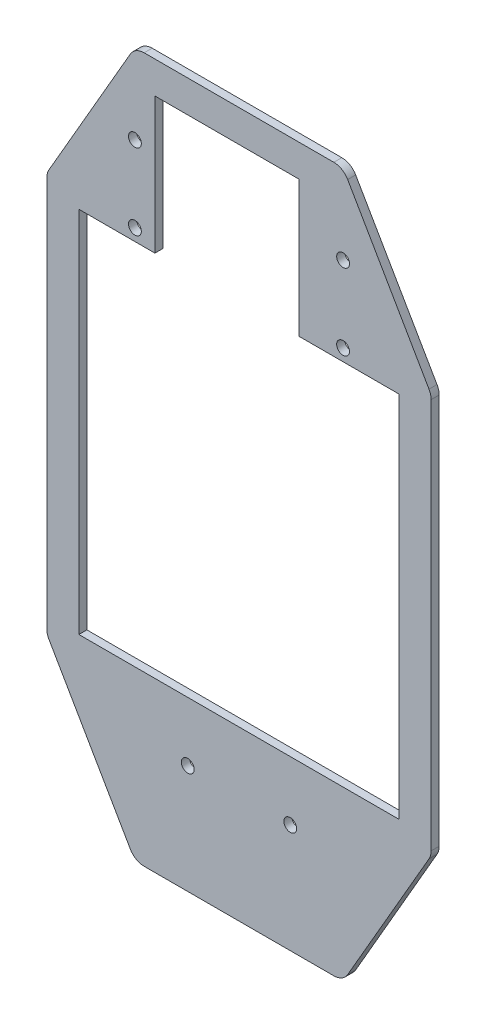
ISO-10303-21;
HEADER;
FILE_DESCRIPTION(('STEP AP214'),'2;1');
FILE_NAME('part.step','',(''),(''),'','','');
FILE_SCHEMA(('AUTOMOTIVE_DESIGN { 1 0 10303 214 1 1 1 1 }'));
ENDSEC;
DATA;
#1=APPLICATION_CONTEXT('core data for automotive mechanical design processes');
#2=APPLICATION_PROTOCOL_DEFINITION('international standard','automotive_design',2000,#1);
#3=PRODUCT_CONTEXT('',#1,'mechanical');
#4=PRODUCT('Part','Part','',(#3));
#5=PRODUCT_RELATED_PRODUCT_CATEGORY('part','',(#4));
#6=PRODUCT_DEFINITION_FORMATION('','',#4);
#7=PRODUCT_DEFINITION_CONTEXT('part definition',#1,'design');
#8=PRODUCT_DEFINITION('design','',#6,#7);
#9=PRODUCT_DEFINITION_SHAPE('','',#8);
#10=(LENGTH_UNIT() NAMED_UNIT(*) SI_UNIT(.MILLI.,.METRE.));
#11=(NAMED_UNIT(*) PLANE_ANGLE_UNIT() SI_UNIT($,.RADIAN.));
#12=(NAMED_UNIT(*) SI_UNIT($,.STERADIAN.) SOLID_ANGLE_UNIT());
#13=UNCERTAINTY_MEASURE_WITH_UNIT(LENGTH_MEASURE(1.E-05),#10,'distance_accuracy_value','');
#14=(GEOMETRIC_REPRESENTATION_CONTEXT(3) GLOBAL_UNCERTAINTY_ASSIGNED_CONTEXT((#13)) GLOBAL_UNIT_ASSIGNED_CONTEXT((#10,
#11,#12)) REPRESENTATION_CONTEXT('',''));
#15=CARTESIAN_POINT('',(0.,0.,0.));
#16=DIRECTION('',(0.,0.,1.));
#17=DIRECTION('',(1.,0.,0.));
#18=AXIS2_PLACEMENT_3D('',#15,#16,#17);
#19=CARTESIAN_POINT('',(0.,0.,4.));
#20=DIRECTION('',(0.,0.,1.));
#21=DIRECTION('',(1.,0.,0.));
#22=AXIS2_PLACEMENT_3D('',#19,#20,#21);
#23=PLANE('',#22);
#24=CARTESIAN_POINT('',(-32.,-152.,4.));
#25=DIRECTION('',(0.,0.,1.));
#26=DIRECTION('',(1.,0.,0.));
#27=AXIS2_PLACEMENT_3D('',#24,#25,#26);
#28=CIRCLE('',#27,4.00000000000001);
#29=CARTESIAN_POINT('',(-28.,-152.,4.));
#30=VERTEX_POINT('',#29);
#31=EDGE_CURVE('E856',#30,#30,#28,.F.);
#32=ORIENTED_EDGE('',*,*,#31,.F.);
#33=EDGE_LOOP('',(#32));
#34=FACE_BOUND('',#33,.T.);
#35=CARTESIAN_POINT('',(-65.,170.,4.));
#36=DIRECTION('',(0.,0.,1.));
#37=DIRECTION('',(1.,0.,0.));
#38=AXIS2_PLACEMENT_3D('',#35,#36,#37);
#39=CIRCLE('',#38,4.00000000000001);
#40=CARTESIAN_POINT('',(-61.,170.,4.));
#41=VERTEX_POINT('',#40);
#42=EDGE_CURVE('E861',#41,#41,#39,.F.);
#43=ORIENTED_EDGE('',*,*,#42,.F.);
#44=EDGE_LOOP('',(#43));
#45=FACE_BOUND('',#44,.T.);
#46=CARTESIAN_POINT('',(-65.,122.5,4.));
#47=DIRECTION('',(0.,0.,1.));
#48=DIRECTION('',(1.,0.,0.));
#49=AXIS2_PLACEMENT_3D('',#46,#47,#48);
#50=CIRCLE('',#49,4.00000000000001);
#51=CARTESIAN_POINT('',(-61.,122.5,4.));
#52=VERTEX_POINT('',#51);
#53=EDGE_CURVE('E864',#52,#52,#50,.F.);
#54=ORIENTED_EDGE('',*,*,#53,.F.);
#55=EDGE_LOOP('',(#54));
#56=FACE_BOUND('',#55,.T.);
#57=CARTESIAN_POINT('',(32.,-152.,4.));
#58=DIRECTION('',(0.,0.,1.));
#59=DIRECTION('',(1.,0.,0.));
#60=AXIS2_PLACEMENT_3D('',#57,#58,#59);
#61=CIRCLE('',#60,4.00000000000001);
#62=CARTESIAN_POINT('',(36.,-152.,4.));
#63=VERTEX_POINT('',#62);
#64=EDGE_CURVE('E809',#63,#63,#61,.T.);
#65=ORIENTED_EDGE('',*,*,#64,.T.);
#66=EDGE_LOOP('',(#65));
#67=FACE_BOUND('',#66,.T.);
#68=CARTESIAN_POINT('',(65.,170.,4.));
#69=DIRECTION('',(0.,0.,1.));
#70=DIRECTION('',(1.,0.,0.));
#71=AXIS2_PLACEMENT_3D('',#68,#69,#70);
#72=CIRCLE('',#71,4.00000000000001);
#73=CARTESIAN_POINT('',(69.,170.,4.));
#74=VERTEX_POINT('',#73);
#75=EDGE_CURVE('E806',#74,#74,#72,.T.);
#76=ORIENTED_EDGE('',*,*,#75,.T.);
#77=EDGE_LOOP('',(#76));
#78=FACE_BOUND('',#77,.T.);
#79=CARTESIAN_POINT('',(65.,122.5,4.));
#80=DIRECTION('',(0.,0.,1.));
#81=DIRECTION('',(1.,0.,0.));
#82=AXIS2_PLACEMENT_3D('',#79,#80,#81);
#83=CIRCLE('',#82,4.00000000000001);
#84=CARTESIAN_POINT('',(69.,122.5,4.));
#85=VERTEX_POINT('',#84);
#86=EDGE_CURVE('E804',#85,#85,#83,.T.);
#87=ORIENTED_EDGE('',*,*,#86,.T.);
#88=EDGE_LOOP('',(#87));
#89=FACE_BOUND('',#88,.T.);
#90=DIRECTION('',(0.,1.,0.));
#91=VECTOR('',#90,1.);
#92=CARTESIAN_POINT('',(99.9999999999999,116.666666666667,4.));
#93=LINE('',#92,#91);
#94=CARTESIAN_POINT('',(100.,-115.,4.));
#95=VERTEX_POINT('',#94);
#96=CARTESIAN_POINT('',(99.9999999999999,115.,4.));
#97=VERTEX_POINT('',#96);
#98=EDGE_CURVE('E830',#95,#97,#93,.T.);
#99=ORIENTED_EDGE('',*,*,#98,.T.);
#100=DIRECTION('',(-1.,0.,0.));
#101=VECTOR('',#100,1.);
#102=CARTESIAN_POINT('',(-37.5,115.,4.));
#103=LINE('',#102,#101);
#104=CARTESIAN_POINT('',(37.5,115.,4.));
#105=VERTEX_POINT('',#104);
#106=EDGE_CURVE('E822',#97,#105,#103,.T.);
#107=ORIENTED_EDGE('',*,*,#106,.T.);
#108=DIRECTION('',(0.,-1.,0.));
#109=VECTOR('',#108,1.);
#110=CARTESIAN_POINT('',(37.5,200.,4.));
#111=LINE('',#110,#109);
#112=CARTESIAN_POINT('',(37.5,200.,4.));
#113=VERTEX_POINT('',#112);
#114=EDGE_CURVE('E825',#113,#105,#111,.T.);
#115=ORIENTED_EDGE('',*,*,#114,.F.);
#116=DIRECTION('',(-1.,0.,0.));
#117=VECTOR('',#116,1.);
#118=CARTESIAN_POINT('',(47.6609802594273,200.,4.));
#119=LINE('',#118,#117);
#120=CARTESIAN_POINT('',(-52.5,200.,4.));
#121=VERTEX_POINT('',#120);
#122=EDGE_CURVE('E66',#113,#121,#119,.T.);
#123=ORIENTED_EDGE('',*,*,#122,.T.);
#124=DIRECTION('',(0.,1.,0.));
#125=VECTOR('',#124,1.);
#126=CARTESIAN_POINT('',(-52.5,200.,4.));
#127=LINE('',#126,#125);
#128=CARTESIAN_POINT('',(-52.5,115.,4.));
#129=VERTEX_POINT('',#128);
#130=EDGE_CURVE('E817',#129,#121,#127,.T.);
#131=ORIENTED_EDGE('',*,*,#130,.F.);
#132=CARTESIAN_POINT('',(-100.,115.,4.));
#133=VERTEX_POINT('',#132);
#134=EDGE_CURVE('E819',#129,#133,#103,.T.);
#135=ORIENTED_EDGE('',*,*,#134,.T.);
#136=DIRECTION('',(0.,-1.,0.));
#137=VECTOR('',#136,1.);
#138=CARTESIAN_POINT('',(-100.,116.666666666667,4.));
#139=LINE('',#138,#137);
#140=CARTESIAN_POINT('',(-100.,-115.,4.));
#141=VERTEX_POINT('',#140);
#142=EDGE_CURVE('E821',#133,#141,#139,.T.);
#143=ORIENTED_EDGE('',*,*,#142,.T.);
#144=DIRECTION('',(-1.,0.,0.));
#145=VECTOR('',#144,1.);
#146=CARTESIAN_POINT('',(-37.5,-115.,4.));
#147=LINE('',#146,#145);
#148=EDGE_CURVE('E827',#95,#141,#147,.T.);
#149=ORIENTED_EDGE('',*,*,#148,.F.);
#150=EDGE_LOOP('',(#99,#107,#115,#123,#131,#135,#143,#149));
#151=FACE_BOUND('',#150,.T.);
#152=DIRECTION('',(-0.499999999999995,-0.866025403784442,0.));
#153=VECTOR('',#152,1.);
#154=CARTESIAN_POINT('',(77.1058439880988,-199.,4.));
#155=LINE('',#154,#153);
#156=CARTESIAN_POINT('',(118.660254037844,-127.025650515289,4.));
#157=VERTEX_POINT('',#156);
#158=CARTESIAN_POINT('',(67.8682396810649,-215.,4.));
#159=VERTEX_POINT('',#158);
#160=EDGE_CURVE('E245',#157,#159,#155,.T.);
#161=ORIENTED_EDGE('',*,*,#160,.T.);
#162=CARTESIAN_POINT('',(59.2079856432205,-210.,4.));
#163=DIRECTION('',(0.,0.,1.));
#164=DIRECTION('',(1.,0.,0.));
#165=AXIS2_PLACEMENT_3D('',#162,#163,#164);
#166=CIRCLE('',#165,10.);
#167=CARTESIAN_POINT('',(59.2079856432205,-220.,4.));
#168=VERTEX_POINT('',#167);
#169=EDGE_CURVE('E13',#168,#159,#166,.T.);
#170=ORIENTED_EDGE('',*,*,#169,.F.);
#171=DIRECTION('',(1.,0.,0.));
#172=VECTOR('',#171,1.);
#173=CARTESIAN_POINT('',(0.,-220.,4.));
#174=LINE('',#173,#172);
#175=CARTESIAN_POINT('',(-59.2079856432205,-220.,4.));
#176=VERTEX_POINT('',#175);
#177=EDGE_CURVE('E51',#176,#168,#174,.T.);
#178=ORIENTED_EDGE('',*,*,#177,.F.);
#179=CARTESIAN_POINT('',(-59.2079856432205,-210.,4.));
#180=DIRECTION('',(0.,0.,1.));
#181=DIRECTION('',(1.,0.,0.));
#182=AXIS2_PLACEMENT_3D('',#179,#180,#181);
#183=CIRCLE('',#182,10.);
#184=CARTESIAN_POINT('',(-67.8682396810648,-215.,4.));
#185=VERTEX_POINT('',#184);
#186=EDGE_CURVE('E228',#185,#176,#183,.T.);
#187=ORIENTED_EDGE('',*,*,#186,.F.);
#188=DIRECTION('',(-0.499999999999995,0.866025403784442,0.));
#189=VECTOR('',#188,1.);
#190=CARTESIAN_POINT('',(-77.1058439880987,-199.,4.));
#191=LINE('',#190,#189);
#192=CARTESIAN_POINT('',(-118.660254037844,-127.025650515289,4.));
#193=VERTEX_POINT('',#192);
#194=EDGE_CURVE('E338',#185,#193,#191,.T.);
#195=ORIENTED_EDGE('',*,*,#194,.T.);
#196=CARTESIAN_POINT('',(-110.,-122.025650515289,4.));
#197=DIRECTION('',(0.,0.,-1.));
#198=DIRECTION('',(-1.,0.,0.));
#199=AXIS2_PLACEMENT_3D('',#196,#197,#198);
#200=CIRCLE('',#199,9.99999999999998);
#201=CARTESIAN_POINT('',(-120.,-122.025650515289,4.));
#202=VERTEX_POINT('',#201);
#203=EDGE_CURVE('E340',#193,#202,#200,.T.);
#204=ORIENTED_EDGE('',*,*,#203,.T.);
#205=DIRECTION('',(0.,1.,0.));
#206=VECTOR('',#205,1.);
#207=CARTESIAN_POINT('',(-120.,-122.025650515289,4.));
#208=LINE('',#207,#206);
#209=CARTESIAN_POINT('',(-120.,122.025650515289,4.));
#210=VERTEX_POINT('',#209);
#211=EDGE_CURVE('E342',#202,#210,#208,.T.);
#212=ORIENTED_EDGE('',*,*,#211,.T.);
#213=CARTESIAN_POINT('',(-110.,122.025650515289,4.));
#214=DIRECTION('',(0.,0.,-1.));
#215=DIRECTION('',(-1.,0.,0.));
#216=AXIS2_PLACEMENT_3D('',#213,#214,#215);
#217=CIRCLE('',#216,10.);
#218=CARTESIAN_POINT('',(-118.660254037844,127.025650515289,4.));
#219=VERTEX_POINT('',#218);
#220=EDGE_CURVE('E334',#210,#219,#217,.T.);
#221=ORIENTED_EDGE('',*,*,#220,.T.);
#222=DIRECTION('',(0.500000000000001,0.866025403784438,0.));
#223=VECTOR('',#222,1.);
#224=CARTESIAN_POINT('',(-118.660254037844,127.025650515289,4.));
#225=LINE('',#224,#223);
#226=CARTESIAN_POINT('',(-67.8682396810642,215.,4.));
#227=VERTEX_POINT('',#226);
#228=EDGE_CURVE('E225',#219,#227,#225,.T.);
#229=ORIENTED_EDGE('',*,*,#228,.T.);
#230=CARTESIAN_POINT('',(-59.2079856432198,210.,4.));
#231=DIRECTION('',(0.,0.,1.));
#232=DIRECTION('',(1.,0.,0.));
#233=AXIS2_PLACEMENT_3D('',#230,#231,#232);
#234=CIRCLE('',#233,10.);
#235=CARTESIAN_POINT('',(-59.2079856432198,220.,4.));
#236=VERTEX_POINT('',#235);
#237=EDGE_CURVE('E211',#236,#227,#234,.T.);
#238=ORIENTED_EDGE('',*,*,#237,.F.);
#239=DIRECTION('',(-1.,0.,0.));
#240=VECTOR('',#239,1.);
#241=CARTESIAN_POINT('',(0.,220.,4.));
#242=LINE('',#241,#240);
#243=CARTESIAN_POINT('',(59.2079856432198,220.,4.));
#244=VERTEX_POINT('',#243);
#245=EDGE_CURVE('E216',#244,#236,#242,.T.);
#246=ORIENTED_EDGE('',*,*,#245,.F.);
#247=CARTESIAN_POINT('',(59.2079856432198,210.,4.));
#248=DIRECTION('',(0.,0.,1.));
#249=DIRECTION('',(1.,0.,0.));
#250=AXIS2_PLACEMENT_3D('',#247,#248,#249);
#251=CIRCLE('',#250,10.);
#252=CARTESIAN_POINT('',(67.8682396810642,215.,4.));
#253=VERTEX_POINT('',#252);
#254=EDGE_CURVE('E226',#253,#244,#251,.T.);
#255=ORIENTED_EDGE('',*,*,#254,.F.);
#256=DIRECTION('',(0.500000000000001,-0.866025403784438,0.));
#257=VECTOR('',#256,1.);
#258=CARTESIAN_POINT('',(118.660254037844,127.025650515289,4.));
#259=LINE('',#258,#257);
#260=CARTESIAN_POINT('',(118.660254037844,127.025650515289,4.));
#261=VERTEX_POINT('',#260);
#262=EDGE_CURVE('E344',#253,#261,#259,.T.);
#263=ORIENTED_EDGE('',*,*,#262,.T.);
#264=CARTESIAN_POINT('',(110.,122.025650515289,4.));
#265=DIRECTION('',(0.,0.,-1.));
#266=DIRECTION('',(1.,0.,0.));
#267=AXIS2_PLACEMENT_3D('',#264,#265,#266);
#268=CIRCLE('',#267,9.99999999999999);
#269=CARTESIAN_POINT('',(120.,122.025650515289,4.));
#270=VERTEX_POINT('',#269);
#271=EDGE_CURVE('E346',#261,#270,#268,.T.);
#272=ORIENTED_EDGE('',*,*,#271,.T.);
#273=DIRECTION('',(0.,-1.,0.));
#274=VECTOR('',#273,1.);
#275=CARTESIAN_POINT('',(120.,-122.025650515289,4.));
#276=LINE('',#275,#274);
#277=CARTESIAN_POINT('',(120.,-122.025650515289,4.));
#278=VERTEX_POINT('',#277);
#279=EDGE_CURVE('E348',#270,#278,#276,.T.);
#280=ORIENTED_EDGE('',*,*,#279,.T.);
#281=CARTESIAN_POINT('',(110.,-122.025650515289,4.));
#282=DIRECTION('',(0.,0.,-1.));
#283=DIRECTION('',(1.,0.,0.));
#284=AXIS2_PLACEMENT_3D('',#281,#282,#283);
#285=CIRCLE('',#284,9.99999999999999);
#286=EDGE_CURVE('E350',#278,#157,#285,.T.);
#287=ORIENTED_EDGE('',*,*,#286,.T.);
#288=EDGE_LOOP('',(#161,#170,#178,#187,#195,#204,#212,#221,#229,#238,#246,#255,#263,#272,#280,#287));
#289=FACE_BOUND('',#288,.T.);
#290=ADVANCED_FACE('F43',(#34,#45,#56,#67,#78,#89,#151,#289),#23,.F.);
#291=CARTESIAN_POINT('',(-37.5,115.,-10.));
#292=DIRECTION('',(0.,-1.,0.));
#293=DIRECTION('',(0.,0.,-1.));
#294=AXIS2_PLACEMENT_3D('',#291,#292,#293);
#295=PLANE('',#294);
#296=ORIENTED_EDGE('',*,*,#106,.F.);
#297=DIRECTION('',(0.,0.,1.));
#298=VECTOR('',#297,1.);
#299=CARTESIAN_POINT('',(100.,115.,-10.));
#300=LINE('',#299,#298);
#301=CARTESIAN_POINT('',(99.9999999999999,115.,9.));
#302=VERTEX_POINT('',#301);
#303=EDGE_CURVE('E355',#97,#302,#300,.T.);
#304=ORIENTED_EDGE('',*,*,#303,.T.);
#305=DIRECTION('',(-1.,0.,0.));
#306=VECTOR('',#305,1.);
#307=CARTESIAN_POINT('',(-37.5,115.,9.));
#308=LINE('',#307,#306);
#309=CARTESIAN_POINT('',(37.5,115.,9.));
#310=VERTEX_POINT('',#309);
#311=EDGE_CURVE('E294',#302,#310,#308,.T.);
#312=ORIENTED_EDGE('',*,*,#311,.T.);
#313=DIRECTION('',(0.,0.,1.));
#314=VECTOR('',#313,1.);
#315=CARTESIAN_POINT('',(37.5,115.,-10.));
#316=LINE('',#315,#314);
#317=EDGE_CURVE('E291',#105,#310,#316,.T.);
#318=ORIENTED_EDGE('',*,*,#317,.F.);
#319=EDGE_LOOP('',(#296,#304,#312,#318));
#320=FACE_BOUND('',#319,.T.);
#321=ADVANCED_FACE('F445',(#320),#295,.T.);
#322=CARTESIAN_POINT('',(-118.660254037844,127.025650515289,30.));
#323=DIRECTION('',(0.866025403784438,-0.500000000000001,0.));
#324=DIRECTION('',(0.500000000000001,0.866025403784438,0.));
#325=AXIS2_PLACEMENT_3D('',#322,#323,#324);
#326=PLANE('',#325);
#327=DIRECTION('',(0.,0.,-1.));
#328=VECTOR('',#327,1.);
#329=CARTESIAN_POINT('',(-67.8682396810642,215.,30.));
#330=LINE('',#329,#328);
#331=CARTESIAN_POINT('',(-67.8682396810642,215.,9.));
#332=VERTEX_POINT('',#331);
#333=EDGE_CURVE('E213',#332,#227,#330,.T.);
#334=ORIENTED_EDGE('',*,*,#333,.T.);
#335=ORIENTED_EDGE('',*,*,#228,.F.);
#336=DIRECTION('',(0.,0.,-1.));
#337=VECTOR('',#336,1.);
#338=CARTESIAN_POINT('',(-118.660254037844,127.025650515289,30.));
#339=LINE('',#338,#337);
#340=CARTESIAN_POINT('',(-118.660254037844,127.025650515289,9.));
#341=VERTEX_POINT('',#340);
#342=EDGE_CURVE('E366',#341,#219,#339,.T.);
#343=ORIENTED_EDGE('',*,*,#342,.F.);
#344=DIRECTION('',(-0.500000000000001,-0.866025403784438,0.));
#345=VECTOR('',#344,1.);
#346=CARTESIAN_POINT('',(-118.660254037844,127.025650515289,9.));
#347=LINE('',#346,#345);
#348=EDGE_CURVE('E326',#332,#341,#347,.T.);
#349=ORIENTED_EDGE('',*,*,#348,.F.);
#350=EDGE_LOOP('',(#334,#335,#343,#349));
#351=FACE_BOUND('',#350,.T.);
#352=ADVANCED_FACE('F417',(#351),#326,.F.);
#353=CARTESIAN_POINT('',(-110.,-122.025650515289,30.));
#354=DIRECTION('',(0.,0.,-1.));
#355=DIRECTION('',(-1.,0.,0.));
#356=AXIS2_PLACEMENT_3D('',#353,#354,#355);
#357=CYLINDRICAL_SURFACE('',#356,9.99999999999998);
#358=CARTESIAN_POINT('',(-110.,-122.025650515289,9.));
#359=DIRECTION('',(0.,0.,1.));
#360=DIRECTION('',(1.,0.,0.));
#361=AXIS2_PLACEMENT_3D('',#358,#359,#360);
#362=CIRCLE('',#361,9.99999999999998);
#363=CARTESIAN_POINT('',(-120.,-122.025650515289,9.));
#364=VERTEX_POINT('',#363);
#365=CARTESIAN_POINT('',(-118.660254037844,-127.025650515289,9.));
#366=VERTEX_POINT('',#365);
#367=EDGE_CURVE('E318',#364,#366,#362,.T.);
#368=ORIENTED_EDGE('',*,*,#367,.F.);
#369=DIRECTION('',(0.,0.,-1.));
#370=VECTOR('',#369,1.);
#371=CARTESIAN_POINT('',(-120.,-122.025650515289,30.));
#372=LINE('',#371,#370);
#373=EDGE_CURVE('E360',#364,#202,#372,.T.);
#374=ORIENTED_EDGE('',*,*,#373,.T.);
#375=ORIENTED_EDGE('',*,*,#203,.F.);
#376=DIRECTION('',(0.,0.,-1.));
#377=VECTOR('',#376,1.);
#378=CARTESIAN_POINT('',(-118.660254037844,-127.025650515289,30.));
#379=LINE('',#378,#377);
#380=EDGE_CURVE('E260',#366,#193,#379,.T.);
#381=ORIENTED_EDGE('',*,*,#380,.F.);
#382=EDGE_LOOP('',(#368,#374,#375,#381));
#383=FACE_BOUND('',#382,.T.);
#384=ADVANCED_FACE('F45',(#383),#357,.T.);
#385=CARTESIAN_POINT('',(-118.660254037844,-127.025650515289,30.));
#386=DIRECTION('',(0.866025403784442,0.499999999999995,0.));
#387=DIRECTION('',(-0.499999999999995,0.866025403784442,0.));
#388=AXIS2_PLACEMENT_3D('',#385,#386,#387);
#389=PLANE('',#388);
#390=ORIENTED_EDGE('',*,*,#194,.F.);
#391=DIRECTION('',(0.,0.,-1.));
#392=VECTOR('',#391,1.);
#393=CARTESIAN_POINT('',(-67.8682396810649,-215.,30.));
#394=LINE('',#393,#392);
#395=CARTESIAN_POINT('',(-67.8682396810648,-215.,9.));
#396=VERTEX_POINT('',#395);
#397=EDGE_CURVE('E253',#396,#185,#394,.T.);
#398=ORIENTED_EDGE('',*,*,#397,.F.);
#399=DIRECTION('',(0.499999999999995,-0.866025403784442,0.));
#400=VECTOR('',#399,1.);
#401=CARTESIAN_POINT('',(-118.660254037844,-127.025650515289,9.));
#402=LINE('',#401,#400);
#403=EDGE_CURVE('E316',#366,#396,#402,.T.);
#404=ORIENTED_EDGE('',*,*,#403,.F.);
#405=ORIENTED_EDGE('',*,*,#380,.T.);
#406=EDGE_LOOP('',(#390,#398,#404,#405));
#407=FACE_BOUND('',#406,.T.);
#408=ADVANCED_FACE('F401',(#407),#389,.F.);
#409=CARTESIAN_POINT('',(-110.,122.025650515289,30.));
#410=DIRECTION('',(0.,0.,-1.));
#411=DIRECTION('',(-1.,0.,0.));
#412=AXIS2_PLACEMENT_3D('',#409,#410,#411);
#413=CYLINDRICAL_SURFACE('',#412,10.);
#414=CARTESIAN_POINT('',(-110.,122.025650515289,9.));
#415=DIRECTION('',(0.,0.,1.));
#416=DIRECTION('',(1.,0.,0.));
#417=AXIS2_PLACEMENT_3D('',#414,#415,#416);
#418=CIRCLE('',#417,10.);
#419=CARTESIAN_POINT('',(-120.,122.025650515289,9.));
#420=VERTEX_POINT('',#419);
#421=EDGE_CURVE('E324',#341,#420,#418,.T.);
#422=ORIENTED_EDGE('',*,*,#421,.F.);
#423=ORIENTED_EDGE('',*,*,#342,.T.);
#424=ORIENTED_EDGE('',*,*,#220,.F.);
#425=DIRECTION('',(0.,0.,-1.));
#426=VECTOR('',#425,1.);
#427=CARTESIAN_POINT('',(-120.,122.025650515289,30.));
#428=LINE('',#427,#426);
#429=EDGE_CURVE('E363',#420,#210,#428,.T.);
#430=ORIENTED_EDGE('',*,*,#429,.F.);
#431=EDGE_LOOP('',(#422,#423,#424,#430));
#432=FACE_BOUND('',#431,.T.);
#433=ADVANCED_FACE('F414',(#432),#413,.T.);
#434=CARTESIAN_POINT('',(-120.,122.025650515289,30.));
#435=DIRECTION('',(1.,0.,0.));
#436=DIRECTION('',(0.,1.,0.));
#437=AXIS2_PLACEMENT_3D('',#434,#435,#436);
#438=PLANE('',#437);
#439=DIRECTION('',(0.,-1.,0.));
#440=VECTOR('',#439,1.);
#441=CARTESIAN_POINT('',(-120.,122.025650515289,9.));
#442=LINE('',#441,#440);
#443=EDGE_CURVE('E322',#420,#364,#442,.T.);
#444=ORIENTED_EDGE('',*,*,#443,.F.);
#445=ORIENTED_EDGE('',*,*,#429,.T.);
#446=ORIENTED_EDGE('',*,*,#211,.F.);
#447=ORIENTED_EDGE('',*,*,#373,.F.);
#448=EDGE_LOOP('',(#444,#445,#446,#447));
#449=FACE_BOUND('',#448,.T.);
#450=ADVANCED_FACE('F408',(#449),#438,.F.);
#451=CARTESIAN_POINT('',(-59.2079856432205,-210.,30.));
#452=DIRECTION('',(0.,0.,-1.));
#453=DIRECTION('',(-1.,0.,0.));
#454=AXIS2_PLACEMENT_3D('',#451,#452,#453);
#455=CYLINDRICAL_SURFACE('',#454,10.);
#456=CARTESIAN_POINT('',(-59.2079856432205,-210.,9.));
#457=DIRECTION('',(0.,0.,1.));
#458=DIRECTION('',(1.,0.,0.));
#459=AXIS2_PLACEMENT_3D('',#456,#457,#458);
#460=CIRCLE('',#459,10.);
#461=CARTESIAN_POINT('',(-59.2079856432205,-220.,9.));
#462=VERTEX_POINT('',#461);
#463=EDGE_CURVE('E314',#396,#462,#460,.T.);
#464=ORIENTED_EDGE('',*,*,#463,.F.);
#465=ORIENTED_EDGE('',*,*,#397,.T.);
#466=ORIENTED_EDGE('',*,*,#186,.T.);
#467=DIRECTION('',(0.,0.,-1.));
#468=VECTOR('',#467,1.);
#469=CARTESIAN_POINT('',(-59.2079856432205,-220.,30.));
#470=LINE('',#469,#468);
#471=EDGE_CURVE('E242',#462,#176,#470,.T.);
#472=ORIENTED_EDGE('',*,*,#471,.F.);
#473=EDGE_LOOP('',(#464,#465,#466,#472));
#474=FACE_BOUND('',#473,.T.);
#475=ADVANCED_FACE('F394',(#474),#455,.T.);
#476=CARTESIAN_POINT('',(59.2079856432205,-220.,30.));
#477=DIRECTION('',(0.,1.,0.));
#478=DIRECTION('',(0.,0.,1.));
#479=AXIS2_PLACEMENT_3D('',#476,#477,#478);
#480=PLANE('',#479);
#481=DIRECTION('',(1.,0.,0.));
#482=VECTOR('',#481,1.);
#483=CARTESIAN_POINT('',(59.2079856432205,-220.,9.));
#484=LINE('',#483,#482);
#485=CARTESIAN_POINT('',(59.2079856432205,-220.,9.));
#486=VERTEX_POINT('',#485);
#487=EDGE_CURVE('E312',#462,#486,#484,.T.);
#488=ORIENTED_EDGE('',*,*,#487,.F.);
#489=ORIENTED_EDGE('',*,*,#471,.T.);
#490=ORIENTED_EDGE('',*,*,#177,.T.);
#491=DIRECTION('',(0.,0.,-1.));
#492=VECTOR('',#491,1.);
#493=CARTESIAN_POINT('',(59.2079856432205,-220.,30.));
#494=LINE('',#493,#492);
#495=EDGE_CURVE('E240',#486,#168,#494,.T.);
#496=ORIENTED_EDGE('',*,*,#495,.F.);
#497=EDGE_LOOP('',(#488,#489,#490,#496));
#498=FACE_BOUND('',#497,.T.);
#499=ADVANCED_FACE('F239',(#498),#480,.F.);
#500=CARTESIAN_POINT('',(59.2079856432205,-210.,30.));
#501=DIRECTION('',(0.,0.,-1.));
#502=DIRECTION('',(-1.,0.,0.));
#503=AXIS2_PLACEMENT_3D('',#500,#501,#502);
#504=CYLINDRICAL_SURFACE('',#503,10.);
#505=CARTESIAN_POINT('',(59.2079856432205,-210.,9.));
#506=DIRECTION('',(0.,0.,1.));
#507=DIRECTION('',(1.,0.,0.));
#508=AXIS2_PLACEMENT_3D('',#505,#506,#507);
#509=CIRCLE('',#508,10.);
#510=CARTESIAN_POINT('',(67.8682396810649,-215.,9.));
#511=VERTEX_POINT('',#510);
#512=EDGE_CURVE('E251',#486,#511,#509,.T.);
#513=ORIENTED_EDGE('',*,*,#512,.F.);
#514=ORIENTED_EDGE('',*,*,#495,.T.);
#515=ORIENTED_EDGE('',*,*,#169,.T.);
#516=DIRECTION('',(0.,0.,-1.));
#517=VECTOR('',#516,1.);
#518=CARTESIAN_POINT('',(67.8682396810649,-215.,30.));
#519=LINE('',#518,#517);
#520=EDGE_CURVE('E250',#511,#159,#519,.T.);
#521=ORIENTED_EDGE('',*,*,#520,.F.);
#522=EDGE_LOOP('',(#513,#514,#515,#521));
#523=FACE_BOUND('',#522,.T.);
#524=ADVANCED_FACE('F249',(#523),#504,.T.);
#525=CARTESIAN_POINT('',(37.5,200.,-10.));
#526=DIRECTION('',(1.,0.,0.));
#527=DIRECTION('',(0.,1.,0.));
#528=AXIS2_PLACEMENT_3D('',#525,#526,#527);
#529=PLANE('',#528);
#530=DIRECTION('',(0.,0.,1.));
#531=VECTOR('',#530,1.);
#532=CARTESIAN_POINT('',(37.5,200.,30.));
#533=LINE('',#532,#531);
#534=CARTESIAN_POINT('',(37.5,200.,9.));
#535=VERTEX_POINT('',#534);
#536=EDGE_CURVE('E220',#113,#535,#533,.T.);
#537=ORIENTED_EDGE('',*,*,#536,.F.);
#538=ORIENTED_EDGE('',*,*,#114,.T.);
#539=ORIENTED_EDGE('',*,*,#317,.T.);
#540=DIRECTION('',(0.,-1.,0.));
#541=VECTOR('',#540,1.);
#542=CARTESIAN_POINT('',(37.5,200.,9.));
#543=LINE('',#542,#541);
#544=EDGE_CURVE('E282',#535,#310,#543,.T.);
#545=ORIENTED_EDGE('',*,*,#544,.F.);
#546=EDGE_LOOP('',(#537,#538,#539,#545));
#547=FACE_BOUND('',#546,.T.);
#548=ADVANCED_FACE('F289',(#547),#529,.F.);
#549=CARTESIAN_POINT('',(47.6609802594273,200.,30.));
#550=DIRECTION('',(0.,-1.,0.));
#551=DIRECTION('',(0.,0.,-1.));
#552=AXIS2_PLACEMENT_3D('',#549,#550,#551);
#553=PLANE('',#552);
#554=ORIENTED_EDGE('',*,*,#122,.F.);
#555=ORIENTED_EDGE('',*,*,#536,.T.);
#556=DIRECTION('',(-1.,0.,0.));
#557=VECTOR('',#556,1.);
#558=CARTESIAN_POINT('',(47.6609802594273,200.,9.));
#559=LINE('',#558,#557);
#560=CARTESIAN_POINT('',(-52.5,200.,8.99999999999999));
#561=VERTEX_POINT('',#560);
#562=EDGE_CURVE('E271',#535,#561,#559,.T.);
#563=ORIENTED_EDGE('',*,*,#562,.T.);
#564=DIRECTION('',(0.,0.,1.));
#565=VECTOR('',#564,1.);
#566=CARTESIAN_POINT('',(-52.5,200.,-86.3133825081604));
#567=LINE('',#566,#565);
#568=EDGE_CURVE('E331',#121,#561,#567,.T.);
#569=ORIENTED_EDGE('',*,*,#568,.F.);
#570=EDGE_LOOP('',(#554,#555,#563,#569));
#571=FACE_BOUND('',#570,.T.);
#572=ADVANCED_FACE('F269',(#571),#553,.T.);
#573=CARTESIAN_POINT('',(118.660254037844,127.025650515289,30.));
#574=DIRECTION('',(-0.866025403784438,-0.500000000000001,0.));
#575=DIRECTION('',(0.500000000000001,-0.866025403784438,0.));
#576=AXIS2_PLACEMENT_3D('',#573,#574,#575);
#577=PLANE('',#576);
#578=ORIENTED_EDGE('',*,*,#262,.F.);
#579=DIRECTION('',(0.,0.,-1.));
#580=VECTOR('',#579,1.);
#581=CARTESIAN_POINT('',(67.8682396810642,215.,30.));
#582=LINE('',#581,#580);
#583=CARTESIAN_POINT('',(67.8682396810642,215.,9.));
#584=VERTEX_POINT('',#583);
#585=EDGE_CURVE('E371',#584,#253,#582,.T.);
#586=ORIENTED_EDGE('',*,*,#585,.F.);
#587=DIRECTION('',(-0.500000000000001,0.866025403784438,0.));
#588=VECTOR('',#587,1.);
#589=CARTESIAN_POINT('',(118.660254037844,127.025650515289,9.));
#590=LINE('',#589,#588);
#591=CARTESIAN_POINT('',(118.660254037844,127.025650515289,9.));
#592=VERTEX_POINT('',#591);
#593=EDGE_CURVE('E309',#592,#584,#590,.T.);
#594=ORIENTED_EDGE('',*,*,#593,.F.);
#595=DIRECTION('',(0.,0.,-1.));
#596=VECTOR('',#595,1.);
#597=CARTESIAN_POINT('',(118.660254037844,127.025650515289,30.));
#598=LINE('',#597,#596);
#599=EDGE_CURVE('E373',#592,#261,#598,.T.);
#600=ORIENTED_EDGE('',*,*,#599,.T.);
#601=EDGE_LOOP('',(#578,#586,#594,#600));
#602=FACE_BOUND('',#601,.T.);
#603=ADVANCED_FACE('F427',(#602),#577,.F.);
#604=CARTESIAN_POINT('',(59.2079856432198,210.,30.));
#605=DIRECTION('',(0.,0.,-1.));
#606=DIRECTION('',(-1.,0.,0.));
#607=AXIS2_PLACEMENT_3D('',#604,#605,#606);
#608=CYLINDRICAL_SURFACE('',#607,10.);
#609=CARTESIAN_POINT('',(59.2079856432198,210.,9.));
#610=DIRECTION('',(0.,0.,1.));
#611=DIRECTION('',(1.,0.,0.));
#612=AXIS2_PLACEMENT_3D('',#609,#610,#611);
#613=CIRCLE('',#612,10.);
#614=CARTESIAN_POINT('',(59.2079856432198,220.,9.));
#615=VERTEX_POINT('',#614);
#616=EDGE_CURVE('E320',#584,#615,#613,.T.);
#617=ORIENTED_EDGE('',*,*,#616,.F.);
#618=ORIENTED_EDGE('',*,*,#585,.T.);
#619=ORIENTED_EDGE('',*,*,#254,.T.);
#620=DIRECTION('',(0.,0.,-1.));
#621=VECTOR('',#620,1.);
#622=CARTESIAN_POINT('',(59.2079856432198,220.,30.));
#623=LINE('',#622,#621);
#624=EDGE_CURVE('E58',#615,#244,#623,.T.);
#625=ORIENTED_EDGE('',*,*,#624,.F.);
#626=EDGE_LOOP('',(#617,#618,#619,#625));
#627=FACE_BOUND('',#626,.T.);
#628=ADVANCED_FACE('F420',(#627),#608,.T.);
#629=CARTESIAN_POINT('',(59.2079856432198,220.,30.));
#630=DIRECTION('',(0.,-1.,0.));
#631=DIRECTION('',(0.,0.,-1.));
#632=AXIS2_PLACEMENT_3D('',#629,#630,#631);
#633=PLANE('',#632);
#634=DIRECTION('',(-1.,0.,0.));
#635=VECTOR('',#634,1.);
#636=CARTESIAN_POINT('',(59.2079856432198,220.,9.));
#637=LINE('',#636,#635);
#638=CARTESIAN_POINT('',(-59.2079856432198,220.,9.));
#639=VERTEX_POINT('',#638);
#640=EDGE_CURVE('E329',#615,#639,#637,.T.);
#641=ORIENTED_EDGE('',*,*,#640,.F.);
#642=ORIENTED_EDGE('',*,*,#624,.T.);
#643=ORIENTED_EDGE('',*,*,#245,.T.);
#644=DIRECTION('',(0.,0.,-1.));
#645=VECTOR('',#644,1.);
#646=CARTESIAN_POINT('',(-59.2079856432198,220.,30.));
#647=LINE('',#646,#645);
#648=EDGE_CURVE('E207',#639,#236,#647,.T.);
#649=ORIENTED_EDGE('',*,*,#648,.F.);
#650=EDGE_LOOP('',(#641,#642,#643,#649));
#651=FACE_BOUND('',#650,.T.);
#652=ADVANCED_FACE('F217',(#651),#633,.F.);
#653=CARTESIAN_POINT('',(-59.2079856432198,210.,30.));
#654=DIRECTION('',(0.,0.,-1.));
#655=DIRECTION('',(-1.,0.,0.));
#656=AXIS2_PLACEMENT_3D('',#653,#654,#655);
#657=CYLINDRICAL_SURFACE('',#656,10.);
#658=CARTESIAN_POINT('',(-59.2079856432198,210.,9.));
#659=DIRECTION('',(0.,0.,1.));
#660=DIRECTION('',(1.,0.,0.));
#661=AXIS2_PLACEMENT_3D('',#658,#659,#660);
#662=CIRCLE('',#661,10.);
#663=EDGE_CURVE('E212',#639,#332,#662,.T.);
#664=ORIENTED_EDGE('',*,*,#663,.F.);
#665=ORIENTED_EDGE('',*,*,#648,.T.);
#666=ORIENTED_EDGE('',*,*,#237,.T.);
#667=ORIENTED_EDGE('',*,*,#333,.F.);
#668=EDGE_LOOP('',(#664,#665,#666,#667));
#669=FACE_BOUND('',#668,.T.);
#670=ADVANCED_FACE('F208',(#669),#657,.T.);
#671=CARTESIAN_POINT('',(99.9999999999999,116.666666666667,30.));
#672=DIRECTION('',(-1.,0.,0.));
#673=DIRECTION('',(0.,-1.,0.));
#674=AXIS2_PLACEMENT_3D('',#671,#672,#673);
#675=PLANE('',#674);
#676=ORIENTED_EDGE('',*,*,#98,.F.);
#677=DIRECTION('',(0.,0.,1.));
#678=VECTOR('',#677,1.);
#679=CARTESIAN_POINT('',(100.,-115.,-10.));
#680=LINE('',#679,#678);
#681=CARTESIAN_POINT('',(100.,-115.,9.));
#682=VERTEX_POINT('',#681);
#683=EDGE_CURVE('E353',#95,#682,#680,.T.);
#684=ORIENTED_EDGE('',*,*,#683,.T.);
#685=DIRECTION('',(0.,1.,0.));
#686=VECTOR('',#685,1.);
#687=CARTESIAN_POINT('',(99.9999999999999,116.666666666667,9.));
#688=LINE('',#687,#686);
#689=EDGE_CURVE('E298',#682,#302,#688,.T.);
#690=ORIENTED_EDGE('',*,*,#689,.T.);
#691=ORIENTED_EDGE('',*,*,#303,.F.);
#692=EDGE_LOOP('',(#676,#684,#690,#691));
#693=FACE_BOUND('',#692,.T.);
#694=ADVANCED_FACE('F477',(#693),#675,.T.);
#695=CARTESIAN_POINT('',(-100.,116.666666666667,30.));
#696=DIRECTION('',(1.,0.,0.));
#697=DIRECTION('',(0.,1.,0.));
#698=AXIS2_PLACEMENT_3D('',#695,#696,#697);
#699=PLANE('',#698);
#700=ORIENTED_EDGE('',*,*,#142,.F.);
#701=DIRECTION('',(0.,0.,-1.));
#702=VECTOR('',#701,1.);
#703=CARTESIAN_POINT('',(-100.,115.,30.));
#704=LINE('',#703,#702);
#705=CARTESIAN_POINT('',(-100.,115.,9.));
#706=VERTEX_POINT('',#705);
#707=EDGE_CURVE('E263',#706,#133,#704,.T.);
#708=ORIENTED_EDGE('',*,*,#707,.F.);
#709=DIRECTION('',(0.,-1.,0.));
#710=VECTOR('',#709,1.);
#711=CARTESIAN_POINT('',(-100.,116.666666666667,9.));
#712=LINE('',#711,#710);
#713=CARTESIAN_POINT('',(-100.,-115.,9.));
#714=VERTEX_POINT('',#713);
#715=EDGE_CURVE('E287',#706,#714,#712,.T.);
#716=ORIENTED_EDGE('',*,*,#715,.T.);
#717=DIRECTION('',(0.,0.,1.));
#718=VECTOR('',#717,1.);
#719=CARTESIAN_POINT('',(-100.,-115.,-10.));
#720=LINE('',#719,#718);
#721=EDGE_CURVE('E357',#141,#714,#720,.T.);
#722=ORIENTED_EDGE('',*,*,#721,.F.);
#723=EDGE_LOOP('',(#700,#708,#716,#722));
#724=FACE_BOUND('',#723,.T.);
#725=ADVANCED_FACE('F474',(#724),#699,.T.);
#726=CARTESIAN_POINT('',(118.660254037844,-127.025650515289,30.));
#727=DIRECTION('',(-0.866025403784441,0.499999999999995,0.));
#728=DIRECTION('',(-0.499999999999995,-0.866025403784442,0.));
#729=AXIS2_PLACEMENT_3D('',#726,#727,#728);
#730=PLANE('',#729);
#731=ORIENTED_EDGE('',*,*,#520,.T.);
#732=ORIENTED_EDGE('',*,*,#160,.F.);
#733=DIRECTION('',(0.,0.,-1.));
#734=VECTOR('',#733,1.);
#735=CARTESIAN_POINT('',(118.660254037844,-127.025650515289,30.));
#736=LINE('',#735,#734);
#737=CARTESIAN_POINT('',(118.660254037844,-127.025650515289,9.));
#738=VERTEX_POINT('',#737);
#739=EDGE_CURVE('E255',#738,#157,#736,.T.);
#740=ORIENTED_EDGE('',*,*,#739,.F.);
#741=DIRECTION('',(0.499999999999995,0.866025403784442,0.));
#742=VECTOR('',#741,1.);
#743=CARTESIAN_POINT('',(118.660254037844,-127.025650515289,9.));
#744=LINE('',#743,#742);
#745=EDGE_CURVE('E307',#511,#738,#744,.T.);
#746=ORIENTED_EDGE('',*,*,#745,.F.);
#747=EDGE_LOOP('',(#731,#732,#740,#746));
#748=FACE_BOUND('',#747,.T.);
#749=ADVANCED_FACE('F390',(#748),#730,.F.);
#750=CARTESIAN_POINT('',(110.,-122.025650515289,30.));
#751=DIRECTION('',(0.,0.,-1.));
#752=DIRECTION('',(-1.,0.,0.));
#753=AXIS2_PLACEMENT_3D('',#750,#751,#752);
#754=CYLINDRICAL_SURFACE('',#753,9.99999999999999);
#755=CARTESIAN_POINT('',(110.,-122.025650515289,9.));
#756=DIRECTION('',(0.,0.,1.));
#757=DIRECTION('',(1.,0.,0.));
#758=AXIS2_PLACEMENT_3D('',#755,#756,#757);
#759=CIRCLE('',#758,9.99999999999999);
#760=CARTESIAN_POINT('',(120.,-122.025650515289,9.));
#761=VERTEX_POINT('',#760);
#762=EDGE_CURVE('E305',#738,#761,#759,.T.);
#763=ORIENTED_EDGE('',*,*,#762,.F.);
#764=ORIENTED_EDGE('',*,*,#739,.T.);
#765=ORIENTED_EDGE('',*,*,#286,.F.);
#766=DIRECTION('',(0.,0.,-1.));
#767=VECTOR('',#766,1.);
#768=CARTESIAN_POINT('',(120.,-122.025650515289,30.));
#769=LINE('',#768,#767);
#770=EDGE_CURVE('E379',#761,#278,#769,.T.);
#771=ORIENTED_EDGE('',*,*,#770,.F.);
#772=EDGE_LOOP('',(#763,#764,#765,#771));
#773=FACE_BOUND('',#772,.T.);
#774=ADVANCED_FACE('F386',(#773),#754,.T.);
#775=CARTESIAN_POINT('',(120.,122.025650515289,30.));
#776=DIRECTION('',(-1.,0.,0.));
#777=DIRECTION('',(0.,-1.,0.));
#778=AXIS2_PLACEMENT_3D('',#775,#776,#777);
#779=PLANE('',#778);
#780=DIRECTION('',(0.,1.,0.));
#781=VECTOR('',#780,1.);
#782=CARTESIAN_POINT('',(120.,122.025650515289,9.));
#783=LINE('',#782,#781);
#784=CARTESIAN_POINT('',(120.,122.025650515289,9.));
#785=VERTEX_POINT('',#784);
#786=EDGE_CURVE('E303',#761,#785,#783,.T.);
#787=ORIENTED_EDGE('',*,*,#786,.F.);
#788=ORIENTED_EDGE('',*,*,#770,.T.);
#789=ORIENTED_EDGE('',*,*,#279,.F.);
#790=DIRECTION('',(0.,0.,-1.));
#791=VECTOR('',#790,1.);
#792=CARTESIAN_POINT('',(120.,122.025650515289,30.));
#793=LINE('',#792,#791);
#794=EDGE_CURVE('E376',#785,#270,#793,.T.);
#795=ORIENTED_EDGE('',*,*,#794,.F.);
#796=EDGE_LOOP('',(#787,#788,#789,#795));
#797=FACE_BOUND('',#796,.T.);
#798=ADVANCED_FACE('F434',(#797),#779,.F.);
#799=CARTESIAN_POINT('',(110.,122.025650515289,30.));
#800=DIRECTION('',(0.,0.,-1.));
#801=DIRECTION('',(-1.,0.,0.));
#802=AXIS2_PLACEMENT_3D('',#799,#800,#801);
#803=CYLINDRICAL_SURFACE('',#802,10.);
#804=CARTESIAN_POINT('',(110.,122.025650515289,9.));
#805=DIRECTION('',(0.,0.,1.));
#806=DIRECTION('',(1.,0.,0.));
#807=AXIS2_PLACEMENT_3D('',#804,#805,#806);
#808=CIRCLE('',#807,10.);
#809=EDGE_CURVE('E301',#785,#592,#808,.T.);
#810=ORIENTED_EDGE('',*,*,#809,.F.);
#811=ORIENTED_EDGE('',*,*,#794,.T.);
#812=ORIENTED_EDGE('',*,*,#271,.F.);
#813=ORIENTED_EDGE('',*,*,#599,.F.);
#814=EDGE_LOOP('',(#810,#811,#812,#813));
#815=FACE_BOUND('',#814,.T.);
#816=ADVANCED_FACE('F430',(#815),#803,.T.);
#817=ORIENTED_EDGE('',*,*,#134,.F.);
#818=DIRECTION('',(0.,0.,1.));
#819=VECTOR('',#818,1.);
#820=CARTESIAN_POINT('',(-52.5,115.,-86.3133825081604));
#821=LINE('',#820,#819);
#822=CARTESIAN_POINT('',(-52.5,115.,8.99999999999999));
#823=VERTEX_POINT('',#822);
#824=EDGE_CURVE('E332',#129,#823,#821,.T.);
#825=ORIENTED_EDGE('',*,*,#824,.T.);
#826=EDGE_CURVE('E833',#823,#706,#308,.T.);
#827=ORIENTED_EDGE('',*,*,#826,.T.);
#828=ORIENTED_EDGE('',*,*,#707,.T.);
#829=EDGE_LOOP('',(#817,#825,#827,#828));
#830=FACE_BOUND('',#829,.T.);
#831=ADVANCED_FACE('F441',(#830),#295,.T.);
#832=CARTESIAN_POINT('',(-37.5,-115.,-10.));
#833=DIRECTION('',(0.,-1.,0.));
#834=DIRECTION('',(0.,0.,-1.));
#835=AXIS2_PLACEMENT_3D('',#832,#833,#834);
#836=PLANE('',#835);
#837=ORIENTED_EDGE('',*,*,#683,.F.);
#838=ORIENTED_EDGE('',*,*,#148,.T.);
#839=ORIENTED_EDGE('',*,*,#721,.T.);
#840=DIRECTION('',(-1.,0.,0.));
#841=VECTOR('',#840,1.);
#842=CARTESIAN_POINT('',(-37.5,-115.,9.));
#843=LINE('',#842,#841);
#844=EDGE_CURVE('E292',#682,#714,#843,.T.);
#845=ORIENTED_EDGE('',*,*,#844,.F.);
#846=EDGE_LOOP('',(#837,#838,#839,#845));
#847=FACE_BOUND('',#846,.T.);
#848=ADVANCED_FACE('F465',(#847),#836,.F.);
#849=CARTESIAN_POINT('',(-52.5,200.,-86.3133825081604));
#850=DIRECTION('',(-1.,0.,0.));
#851=DIRECTION('',(0.,-1.,0.));
#852=AXIS2_PLACEMENT_3D('',#849,#850,#851);
#853=PLANE('',#852);
#854=ORIENTED_EDGE('',*,*,#824,.F.);
#855=ORIENTED_EDGE('',*,*,#130,.T.);
#856=ORIENTED_EDGE('',*,*,#568,.T.);
#857=DIRECTION('',(0.,1.,0.));
#858=VECTOR('',#857,1.);
#859=CARTESIAN_POINT('',(-52.5,200.,8.99999999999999));
#860=LINE('',#859,#858);
#861=EDGE_CURVE('E286',#823,#561,#860,.T.);
#862=ORIENTED_EDGE('',*,*,#861,.F.);
#863=EDGE_LOOP('',(#854,#855,#856,#862));
#864=FACE_BOUND('',#863,.T.);
#865=ADVANCED_FACE('F461',(#864),#853,.F.);
#866=CARTESIAN_POINT('',(110.,122.025650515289,9.));
#867=DIRECTION('',(0.,0.,1.));
#868=DIRECTION('',(1.,0.,0.));
#869=AXIS2_PLACEMENT_3D('',#866,#867,#868);
#870=PLANE('',#869);
#871=CARTESIAN_POINT('',(-32.,-152.,9.));
#872=DIRECTION('',(0.,0.,-1.));
#873=DIRECTION('',(-1.,0.,0.));
#874=AXIS2_PLACEMENT_3D('',#871,#872,#873);
#875=CIRCLE('',#874,4.00000000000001);
#876=CARTESIAN_POINT('',(-36.,-152.,9.));
#877=VERTEX_POINT('',#876);
#878=EDGE_CURVE('E871',#877,#877,#875,.T.);
#879=ORIENTED_EDGE('',*,*,#878,.T.);
#880=EDGE_LOOP('',(#879));
#881=FACE_BOUND('',#880,.T.);
#882=CARTESIAN_POINT('',(-65.,170.,9.));
#883=DIRECTION('',(0.,0.,-1.));
#884=DIRECTION('',(-1.,0.,0.));
#885=AXIS2_PLACEMENT_3D('',#882,#883,#884);
#886=CIRCLE('',#885,4.00000000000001);
#887=CARTESIAN_POINT('',(-69.,170.,9.));
#888=VERTEX_POINT('',#887);
#889=EDGE_CURVE('E870',#888,#888,#886,.T.);
#890=ORIENTED_EDGE('',*,*,#889,.T.);
#891=EDGE_LOOP('',(#890));
#892=FACE_BOUND('',#891,.T.);
#893=CARTESIAN_POINT('',(-65.,122.5,9.));
#894=DIRECTION('',(0.,0.,-1.));
#895=DIRECTION('',(-1.,0.,0.));
#896=AXIS2_PLACEMENT_3D('',#893,#894,#895);
#897=CIRCLE('',#896,4.00000000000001);
#898=CARTESIAN_POINT('',(-69.,122.5,9.));
#899=VERTEX_POINT('',#898);
#900=EDGE_CURVE('E867',#899,#899,#897,.T.);
#901=ORIENTED_EDGE('',*,*,#900,.T.);
#902=EDGE_LOOP('',(#901));
#903=FACE_BOUND('',#902,.T.);
#904=CARTESIAN_POINT('',(32.,-152.,9.));
#905=DIRECTION('',(0.,0.,1.));
#906=DIRECTION('',(1.,0.,0.));
#907=AXIS2_PLACEMENT_3D('',#904,#905,#906);
#908=CIRCLE('',#907,4.00000000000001);
#909=CARTESIAN_POINT('',(36.,-152.,9.));
#910=VERTEX_POINT('',#909);
#911=EDGE_CURVE('E853',#910,#910,#908,.T.);
#912=ORIENTED_EDGE('',*,*,#911,.F.);
#913=EDGE_LOOP('',(#912));
#914=FACE_BOUND('',#913,.T.);
#915=CARTESIAN_POINT('',(65.,170.,9.));
#916=DIRECTION('',(0.,0.,1.));
#917=DIRECTION('',(1.,0.,0.));
#918=AXIS2_PLACEMENT_3D('',#915,#916,#917);
#919=CIRCLE('',#918,4.00000000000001);
#920=CARTESIAN_POINT('',(69.,170.,9.));
#921=VERTEX_POINT('',#920);
#922=EDGE_CURVE('E811',#921,#921,#919,.T.);
#923=ORIENTED_EDGE('',*,*,#922,.F.);
#924=EDGE_LOOP('',(#923));
#925=FACE_BOUND('',#924,.T.);
#926=CARTESIAN_POINT('',(65.,122.5,9.));
#927=DIRECTION('',(0.,0.,1.));
#928=DIRECTION('',(1.,0.,0.));
#929=AXIS2_PLACEMENT_3D('',#926,#927,#928);
#930=CIRCLE('',#929,4.00000000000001);
#931=CARTESIAN_POINT('',(69.,122.5,9.));
#932=VERTEX_POINT('',#931);
#933=EDGE_CURVE('E801',#932,#932,#930,.T.);
#934=ORIENTED_EDGE('',*,*,#933,.F.);
#935=EDGE_LOOP('',(#934));
#936=FACE_BOUND('',#935,.T.);
#937=ORIENTED_EDGE('',*,*,#844,.T.);
#938=ORIENTED_EDGE('',*,*,#715,.F.);
#939=ORIENTED_EDGE('',*,*,#826,.F.);
#940=ORIENTED_EDGE('',*,*,#861,.T.);
#941=ORIENTED_EDGE('',*,*,#562,.F.);
#942=ORIENTED_EDGE('',*,*,#544,.T.);
#943=ORIENTED_EDGE('',*,*,#311,.F.);
#944=ORIENTED_EDGE('',*,*,#689,.F.);
#945=EDGE_LOOP('',(#937,#938,#939,#940,#941,#942,#943,#944));
#946=FACE_BOUND('',#945,.T.);
#947=ORIENTED_EDGE('',*,*,#640,.T.);
#948=ORIENTED_EDGE('',*,*,#663,.T.);
#949=ORIENTED_EDGE('',*,*,#348,.T.);
#950=ORIENTED_EDGE('',*,*,#421,.T.);
#951=ORIENTED_EDGE('',*,*,#443,.T.);
#952=ORIENTED_EDGE('',*,*,#367,.T.);
#953=ORIENTED_EDGE('',*,*,#403,.T.);
#954=ORIENTED_EDGE('',*,*,#463,.T.);
#955=ORIENTED_EDGE('',*,*,#487,.T.);
#956=ORIENTED_EDGE('',*,*,#512,.T.);
#957=ORIENTED_EDGE('',*,*,#745,.T.);
#958=ORIENTED_EDGE('',*,*,#762,.T.);
#959=ORIENTED_EDGE('',*,*,#786,.T.);
#960=ORIENTED_EDGE('',*,*,#809,.T.);
#961=ORIENTED_EDGE('',*,*,#593,.T.);
#962=ORIENTED_EDGE('',*,*,#616,.T.);
#963=EDGE_LOOP('',(#947,#948,#949,#950,#951,#952,#953,#954,#955,#956,#957,#958,#959,#960,#961,#962));
#964=FACE_BOUND('',#963,.T.);
#965=ADVANCED_FACE('F279',(#881,#892,#903,#914,#925,#936,#946,#964),#870,.T.);
#966=CARTESIAN_POINT('',(65.,122.5,-1.));
#967=DIRECTION('',(0.,0.,1.));
#968=DIRECTION('',(1.,0.,0.));
#969=AXIS2_PLACEMENT_3D('',#966,#967,#968);
#970=CYLINDRICAL_SURFACE('',#969,4.00000000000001);
#971=ORIENTED_EDGE('',*,*,#933,.T.);
#972=EDGE_LOOP('',(#971));
#973=FACE_BOUND('',#972,.T.);
#974=ORIENTED_EDGE('',*,*,#86,.F.);
#975=EDGE_LOOP('',(#974));
#976=FACE_BOUND('',#975,.T.);
#977=ADVANCED_FACE('F457',(#973,#976),#970,.F.);
#978=CARTESIAN_POINT('',(65.,170.,-1.));
#979=DIRECTION('',(0.,0.,1.));
#980=DIRECTION('',(1.,0.,0.));
#981=AXIS2_PLACEMENT_3D('',#978,#979,#980);
#982=CYLINDRICAL_SURFACE('',#981,4.00000000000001);
#983=ORIENTED_EDGE('',*,*,#922,.T.);
#984=EDGE_LOOP('',(#983));
#985=FACE_BOUND('',#984,.T.);
#986=ORIENTED_EDGE('',*,*,#75,.F.);
#987=EDGE_LOOP('',(#986));
#988=FACE_BOUND('',#987,.T.);
#989=ADVANCED_FACE('F715',(#985,#988),#982,.F.);
#990=CARTESIAN_POINT('',(32.,-152.,-1.));
#991=DIRECTION('',(0.,0.,1.));
#992=DIRECTION('',(1.,0.,0.));
#993=AXIS2_PLACEMENT_3D('',#990,#991,#992);
#994=CYLINDRICAL_SURFACE('',#993,4.00000000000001);
#995=ORIENTED_EDGE('',*,*,#911,.T.);
#996=EDGE_LOOP('',(#995));
#997=FACE_BOUND('',#996,.T.);
#998=ORIENTED_EDGE('',*,*,#64,.F.);
#999=EDGE_LOOP('',(#998));
#1000=FACE_BOUND('',#999,.T.);
#1001=ADVANCED_FACE('F709',(#997,#1000),#994,.F.);
#1002=CARTESIAN_POINT('',(-65.,122.5,-1.));
#1003=DIRECTION('',(0.,0.,1.));
#1004=DIRECTION('',(1.,0.,0.));
#1005=AXIS2_PLACEMENT_3D('',#1002,#1003,#1004);
#1006=CYLINDRICAL_SURFACE('',#1005,4.00000000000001);
#1007=ORIENTED_EDGE('',*,*,#900,.F.);
#1008=EDGE_LOOP('',(#1007));
#1009=FACE_BOUND('',#1008,.T.);
#1010=ORIENTED_EDGE('',*,*,#53,.T.);
#1011=EDGE_LOOP('',(#1010));
#1012=FACE_BOUND('',#1011,.T.);
#1013=ADVANCED_FACE('F714',(#1009,#1012),#1006,.F.);
#1014=CARTESIAN_POINT('',(-65.,170.,-1.));
#1015=DIRECTION('',(0.,0.,1.));
#1016=DIRECTION('',(1.,0.,0.));
#1017=AXIS2_PLACEMENT_3D('',#1014,#1015,#1016);
#1018=CYLINDRICAL_SURFACE('',#1017,4.00000000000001);
#1019=ORIENTED_EDGE('',*,*,#889,.F.);
#1020=EDGE_LOOP('',(#1019));
#1021=FACE_BOUND('',#1020,.T.);
#1022=ORIENTED_EDGE('',*,*,#42,.T.);
#1023=EDGE_LOOP('',(#1022));
#1024=FACE_BOUND('',#1023,.T.);
#1025=ADVANCED_FACE('F879',(#1021,#1024),#1018,.F.);
#1026=CARTESIAN_POINT('',(-32.,-152.,-1.));
#1027=DIRECTION('',(0.,0.,1.));
#1028=DIRECTION('',(1.,0.,0.));
#1029=AXIS2_PLACEMENT_3D('',#1026,#1027,#1028);
#1030=CYLINDRICAL_SURFACE('',#1029,4.00000000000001);
#1031=ORIENTED_EDGE('',*,*,#878,.F.);
#1032=EDGE_LOOP('',(#1031));
#1033=FACE_BOUND('',#1032,.T.);
#1034=ORIENTED_EDGE('',*,*,#31,.T.);
#1035=EDGE_LOOP('',(#1034));
#1036=FACE_BOUND('',#1035,.T.);
#1037=ADVANCED_FACE('F882',(#1033,#1036),#1030,.F.);
#1038=CLOSED_SHELL('',(#290,#321,#352,#384,#408,#433,#450,#475,#499,#524,#548,#572,#603,#628,
#652,#670,#694,#725,#749,#774,#798,#816,#831,#848,#865,#965,#977,#989,#1001,#1013,#1025,#1037));
#1039=MANIFOLD_SOLID_BREP('B2',#1038);
#1040=ADVANCED_BREP_SHAPE_REPRESENTATION('',(#18,#1039),#14);
#1041=SHAPE_DEFINITION_REPRESENTATION(#9,#1040);
ENDSEC;
END-ISO-10303-21;
